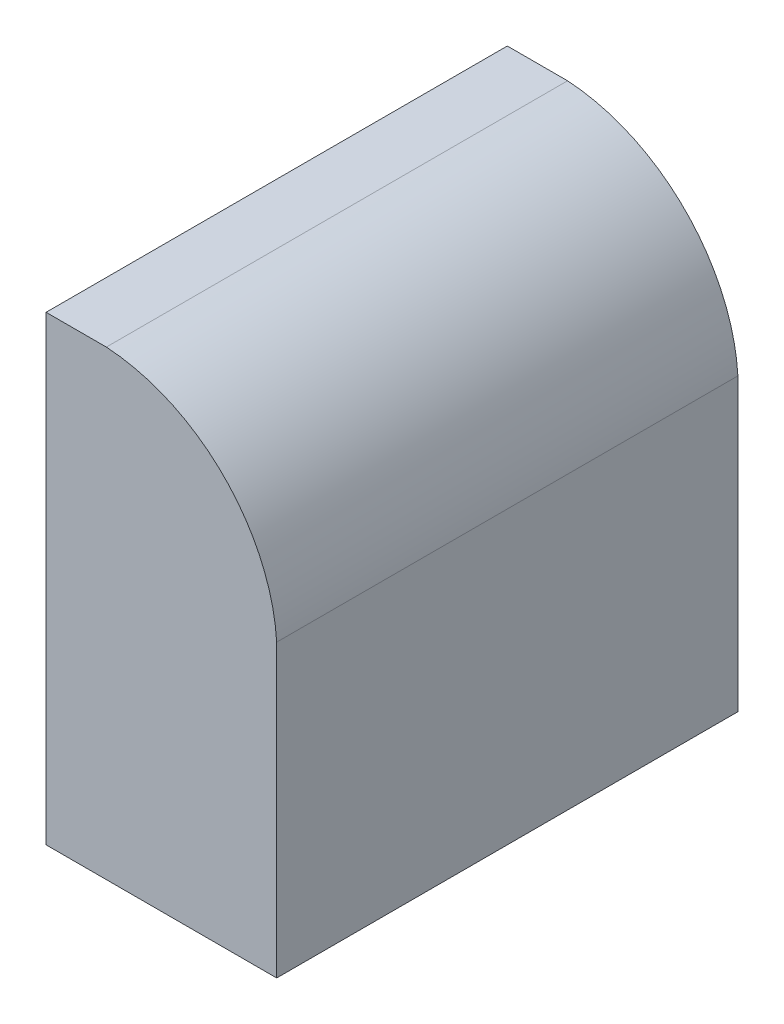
ISO-10303-21;
HEADER;
FILE_DESCRIPTION(('STEP AP214'),'2;1');
FILE_NAME('part.step','',(''),(''),'','','');
FILE_SCHEMA(('AUTOMOTIVE_DESIGN { 1 0 10303 214 1 1 1 1 }'));
ENDSEC;
DATA;
#1=APPLICATION_CONTEXT('core data for automotive mechanical design processes');
#2=APPLICATION_PROTOCOL_DEFINITION('international standard','automotive_design',2000,#1);
#3=PRODUCT_CONTEXT('',#1,'mechanical');
#4=PRODUCT('Part','Part','',(#3));
#5=PRODUCT_RELATED_PRODUCT_CATEGORY('part','',(#4));
#6=PRODUCT_DEFINITION_FORMATION('','',#4);
#7=PRODUCT_DEFINITION_CONTEXT('part definition',#1,'design');
#8=PRODUCT_DEFINITION('design','',#6,#7);
#9=PRODUCT_DEFINITION_SHAPE('','',#8);
#10=(LENGTH_UNIT() NAMED_UNIT(*) SI_UNIT(.MILLI.,.METRE.));
#11=(NAMED_UNIT(*) PLANE_ANGLE_UNIT() SI_UNIT($,.RADIAN.));
#12=(NAMED_UNIT(*) SI_UNIT($,.STERADIAN.) SOLID_ANGLE_UNIT());
#13=UNCERTAINTY_MEASURE_WITH_UNIT(LENGTH_MEASURE(1.E-05),#10,'distance_accuracy_value','');
#14=(GEOMETRIC_REPRESENTATION_CONTEXT(3) GLOBAL_UNCERTAINTY_ASSIGNED_CONTEXT((#13)) GLOBAL_UNIT_ASSIGNED_CONTEXT((#10,
#11,#12)) REPRESENTATION_CONTEXT('',''));
#15=CARTESIAN_POINT('',(0.,0.,0.));
#16=DIRECTION('',(0.,0.,1.));
#17=DIRECTION('',(1.,0.,0.));
#18=AXIS2_PLACEMENT_3D('',#15,#16,#17);
#19=CARTESIAN_POINT('',(0.,0.,25.4));
#20=DIRECTION('',(1.,0.,0.));
#21=DIRECTION('',(0.,0.,-1.));
#22=AXIS2_PLACEMENT_3D('',#19,#20,#21);
#23=PLANE('',#22);
#24=CARTESIAN_POINT('',(0.,19.1185714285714,19.05));
#25=DIRECTION('',(-1.,0.,0.));
#26=DIRECTION('',(0.,0.,1.));
#27=AXIS2_PLACEMENT_3D('',#24,#25,#26);
#28=CIRCLE('',#27,3.175);
#29=CARTESIAN_POINT('',(0.,19.1185714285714,22.225));
#30=VERTEX_POINT('',#29);
#31=EDGE_CURVE('E144',#30,#30,#28,.T.);
#32=ORIENTED_EDGE('',*,*,#31,.F.);
#33=EDGE_LOOP('',(#32));
#34=FACE_BOUND('',#33,.T.);
#35=CARTESIAN_POINT('',(0.,18.8620900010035,6.60928131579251));
#36=DIRECTION('',(-1.,0.,0.));
#37=DIRECTION('',(0.,0.,1.));
#38=AXIS2_PLACEMENT_3D('',#35,#36,#37);
#39=CIRCLE('',#38,3.175);
#40=CARTESIAN_POINT('',(0.,18.8620900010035,9.78428131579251));
#41=VERTEX_POINT('',#40);
#42=EDGE_CURVE('E147',#41,#41,#39,.T.);
#43=ORIENTED_EDGE('',*,*,#42,.F.);
#44=EDGE_LOOP('',(#43));
#45=FACE_BOUND('',#44,.T.);
#46=DIRECTION('',(0.,-1.,0.));
#47=VECTOR('',#46,1.);
#48=CARTESIAN_POINT('',(0.,0.,0.));
#49=LINE('',#48,#47);
#50=CARTESIAN_POINT('',(0.,25.4,0.));
#51=VERTEX_POINT('',#50);
#52=CARTESIAN_POINT('',(0.,0.,0.));
#53=VERTEX_POINT('',#52);
#54=EDGE_CURVE('E107',#51,#53,#49,.T.);
#55=ORIENTED_EDGE('',*,*,#54,.T.);
#56=DIRECTION('',(0.,0.,-1.));
#57=VECTOR('',#56,1.);
#58=CARTESIAN_POINT('',(0.,0.,25.4));
#59=LINE('',#58,#57);
#60=CARTESIAN_POINT('',(0.,0.,25.4));
#61=VERTEX_POINT('',#60);
#62=EDGE_CURVE('E11',#61,#53,#59,.T.);
#63=ORIENTED_EDGE('',*,*,#62,.F.);
#64=DIRECTION('',(0.,-1.,0.));
#65=VECTOR('',#64,1.);
#66=CARTESIAN_POINT('',(0.,0.,25.4));
#67=LINE('',#66,#65);
#68=CARTESIAN_POINT('',(0.,25.4,25.4));
#69=VERTEX_POINT('',#68);
#70=EDGE_CURVE('E116',#69,#61,#67,.T.);
#71=ORIENTED_EDGE('',*,*,#70,.F.);
#72=DIRECTION('',(0.,0.,-1.));
#73=VECTOR('',#72,1.);
#74=CARTESIAN_POINT('',(0.,25.4,25.4));
#75=LINE('',#74,#73);
#76=EDGE_CURVE('E103',#69,#51,#75,.T.);
#77=ORIENTED_EDGE('',*,*,#76,.T.);
#78=EDGE_LOOP('',(#55,#63,#71,#77));
#79=FACE_BOUND('',#78,.T.);
#80=ADVANCED_FACE('F33',(#34,#45,#79),#23,.F.);
#81=CARTESIAN_POINT('',(0.,0.,25.4));
#82=DIRECTION('',(0.,1.,0.));
#83=DIRECTION('',(0.,0.,1.));
#84=AXIS2_PLACEMENT_3D('',#81,#82,#83);
#85=PLANE('',#84);
#86=CARTESIAN_POINT('',(6.35,0.,6.35));
#87=DIRECTION('',(0.,-1.,0.));
#88=DIRECTION('',(0.,0.,-1.));
#89=AXIS2_PLACEMENT_3D('',#86,#87,#88);
#90=CIRCLE('',#89,1.8288);
#91=CARTESIAN_POINT('',(6.35,0.,4.5212));
#92=VERTEX_POINT('',#91);
#93=EDGE_CURVE('E153',#92,#92,#90,.T.);
#94=ORIENTED_EDGE('',*,*,#93,.F.);
#95=EDGE_LOOP('',(#94));
#96=FACE_BOUND('',#95,.T.);
#97=CARTESIAN_POINT('',(6.35,0.,19.05));
#98=DIRECTION('',(0.,-1.,0.));
#99=DIRECTION('',(0.,0.,-1.));
#100=AXIS2_PLACEMENT_3D('',#97,#98,#99);
#101=CIRCLE('',#100,1.8288);
#102=CARTESIAN_POINT('',(6.35,0.,17.2212));
#103=VERTEX_POINT('',#102);
#104=EDGE_CURVE('E162',#103,#103,#101,.T.);
#105=ORIENTED_EDGE('',*,*,#104,.F.);
#106=EDGE_LOOP('',(#105));
#107=FACE_BOUND('',#106,.T.);
#108=DIRECTION('',(1.,0.,0.));
#109=VECTOR('',#108,1.);
#110=CARTESIAN_POINT('',(0.,0.,0.));
#111=LINE('',#110,#109);
#112=CARTESIAN_POINT('',(12.7,0.,0.));
#113=VERTEX_POINT('',#112);
#114=EDGE_CURVE('E110',#53,#113,#111,.T.);
#115=ORIENTED_EDGE('',*,*,#114,.T.);
#116=DIRECTION('',(0.,0.,-1.));
#117=VECTOR('',#116,1.);
#118=CARTESIAN_POINT('',(12.7,0.,25.4));
#119=LINE('',#118,#117);
#120=CARTESIAN_POINT('',(12.7,0.,25.4));
#121=VERTEX_POINT('',#120);
#122=EDGE_CURVE('E41',#121,#113,#119,.T.);
#123=ORIENTED_EDGE('',*,*,#122,.F.);
#124=DIRECTION('',(1.,0.,0.));
#125=VECTOR('',#124,1.);
#126=CARTESIAN_POINT('',(0.,0.,25.4));
#127=LINE('',#126,#125);
#128=EDGE_CURVE('E83',#61,#121,#127,.T.);
#129=ORIENTED_EDGE('',*,*,#128,.F.);
#130=ORIENTED_EDGE('',*,*,#62,.T.);
#131=EDGE_LOOP('',(#115,#123,#129,#130));
#132=FACE_BOUND('',#131,.T.);
#133=ADVANCED_FACE('F135',(#96,#107,#132),#85,.F.);
#134=CARTESIAN_POINT('',(12.7,0.,25.4));
#135=DIRECTION('',(-1.,0.,0.));
#136=DIRECTION('',(0.,0.,1.));
#137=AXIS2_PLACEMENT_3D('',#134,#135,#136);
#138=PLANE('',#137);
#139=DIRECTION('',(0.,1.,0.));
#140=VECTOR('',#139,1.);
#141=CARTESIAN_POINT('',(12.7,0.,0.));
#142=LINE('',#141,#140);
#143=CARTESIAN_POINT('',(12.7,16.0185152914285,0.));
#144=VERTEX_POINT('',#143);
#145=EDGE_CURVE('E98',#113,#144,#142,.T.);
#146=ORIENTED_EDGE('',*,*,#145,.T.);
#147=DIRECTION('',(0.,0.,-1.));
#148=VECTOR('',#147,1.);
#149=CARTESIAN_POINT('',(12.7,16.0185152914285,25.4));
#150=LINE('',#149,#148);
#151=CARTESIAN_POINT('',(12.7,16.0185152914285,25.4));
#152=VERTEX_POINT('',#151);
#153=EDGE_CURVE('E95',#152,#144,#150,.T.);
#154=ORIENTED_EDGE('',*,*,#153,.F.);
#155=DIRECTION('',(0.,1.,0.));
#156=VECTOR('',#155,1.);
#157=CARTESIAN_POINT('',(12.7,0.,25.4));
#158=LINE('',#157,#156);
#159=EDGE_CURVE('E87',#121,#152,#158,.T.);
#160=ORIENTED_EDGE('',*,*,#159,.F.);
#161=ORIENTED_EDGE('',*,*,#122,.T.);
#162=EDGE_LOOP('',(#146,#154,#160,#161));
#163=FACE_BOUND('',#162,.T.);
#164=ADVANCED_FACE('F96',(#163),#138,.F.);
#165=CARTESIAN_POINT('',(2.69005830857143,15.3900583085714,25.4));
#166=DIRECTION('',(0.,0.,-1.));
#167=DIRECTION('',(-1.,0.,0.));
#168=AXIS2_PLACEMENT_3D('',#165,#166,#167);
#169=CYLINDRICAL_SURFACE('',#168,10.0296505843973);
#170=CARTESIAN_POINT('',(2.69005830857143,15.3900583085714,0.));
#171=DIRECTION('',(0.,0.,1.));
#172=DIRECTION('',(-1.,0.,0.));
#173=AXIS2_PLACEMENT_3D('',#170,#171,#172);
#174=CIRCLE('',#173,10.0296505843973);
#175=CARTESIAN_POINT('',(3.31851529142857,25.4,0.));
#176=VERTEX_POINT('',#175);
#177=EDGE_CURVE('E69',#144,#176,#174,.T.);
#178=ORIENTED_EDGE('',*,*,#177,.T.);
#179=DIRECTION('',(0.,0.,-1.));
#180=VECTOR('',#179,1.);
#181=CARTESIAN_POINT('',(3.31851529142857,25.4,25.4));
#182=LINE('',#181,#180);
#183=CARTESIAN_POINT('',(3.31851529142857,25.4,25.4));
#184=VERTEX_POINT('',#183);
#185=EDGE_CURVE('E99',#184,#176,#182,.T.);
#186=ORIENTED_EDGE('',*,*,#185,.F.);
#187=CARTESIAN_POINT('',(2.69005830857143,15.3900583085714,25.4));
#188=DIRECTION('',(0.,0.,1.));
#189=DIRECTION('',(-1.,0.,0.));
#190=AXIS2_PLACEMENT_3D('',#187,#188,#189);
#191=CIRCLE('',#190,10.0296505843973);
#192=EDGE_CURVE('E91',#152,#184,#191,.T.);
#193=ORIENTED_EDGE('',*,*,#192,.F.);
#194=ORIENTED_EDGE('',*,*,#153,.T.);
#195=EDGE_LOOP('',(#178,#186,#193,#194));
#196=FACE_BOUND('',#195,.T.);
#197=ADVANCED_FACE('F101',(#196),#169,.T.);
#198=CARTESIAN_POINT('',(3.31851529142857,25.4,25.4));
#199=DIRECTION('',(0.,-1.,0.));
#200=DIRECTION('',(0.,0.,-1.));
#201=AXIS2_PLACEMENT_3D('',#198,#199,#200);
#202=PLANE('',#201);
#203=DIRECTION('',(-1.,0.,0.));
#204=VECTOR('',#203,1.);
#205=CARTESIAN_POINT('',(3.31851529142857,25.4,0.));
#206=LINE('',#205,#204);
#207=EDGE_CURVE('E75',#176,#51,#206,.T.);
#208=ORIENTED_EDGE('',*,*,#207,.T.);
#209=ORIENTED_EDGE('',*,*,#76,.F.);
#210=DIRECTION('',(-1.,0.,0.));
#211=VECTOR('',#210,1.);
#212=CARTESIAN_POINT('',(3.31851529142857,25.4,25.4));
#213=LINE('',#212,#211);
#214=EDGE_CURVE('E49',#184,#69,#213,.T.);
#215=ORIENTED_EDGE('',*,*,#214,.F.);
#216=ORIENTED_EDGE('',*,*,#185,.T.);
#217=EDGE_LOOP('',(#208,#209,#215,#216));
#218=FACE_BOUND('',#217,.T.);
#219=ADVANCED_FACE('F124',(#218),#202,.F.);
#220=CARTESIAN_POINT('',(2.69005830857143,15.3900583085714,25.4));
#221=DIRECTION('',(0.,0.,-1.));
#222=DIRECTION('',(-1.,0.,0.));
#223=AXIS2_PLACEMENT_3D('',#220,#221,#222);
#224=PLANE('',#223);
#225=ORIENTED_EDGE('',*,*,#70,.T.);
#226=ORIENTED_EDGE('',*,*,#128,.T.);
#227=ORIENTED_EDGE('',*,*,#159,.T.);
#228=ORIENTED_EDGE('',*,*,#192,.T.);
#229=ORIENTED_EDGE('',*,*,#214,.T.);
#230=EDGE_LOOP('',(#225,#226,#227,#228,#229));
#231=FACE_BOUND('',#230,.T.);
#232=ADVANCED_FACE('F89',(#231),#224,.F.);
#233=CARTESIAN_POINT('',(2.69005830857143,15.3900583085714,0.));
#234=DIRECTION('',(0.,0.,-1.));
#235=DIRECTION('',(-1.,0.,0.));
#236=AXIS2_PLACEMENT_3D('',#233,#234,#235);
#237=PLANE('',#236);
#238=ORIENTED_EDGE('',*,*,#54,.F.);
#239=ORIENTED_EDGE('',*,*,#207,.F.);
#240=ORIENTED_EDGE('',*,*,#177,.F.);
#241=ORIENTED_EDGE('',*,*,#145,.F.);
#242=ORIENTED_EDGE('',*,*,#114,.F.);
#243=EDGE_LOOP('',(#238,#239,#240,#241,#242));
#244=FACE_BOUND('',#243,.T.);
#245=ADVANCED_FACE('F120',(#244),#237,.T.);
#246=CARTESIAN_POINT('',(6.35,12.7,19.05));
#247=DIRECTION('',(0.,-1.,0.));
#248=DIRECTION('',(0.,0.,-1.));
#249=AXIS2_PLACEMENT_3D('',#246,#247,#248);
#250=CYLINDRICAL_SURFACE('',#249,1.8288);
#251=CARTESIAN_POINT('',(6.35,12.7,19.05));
#252=DIRECTION('',(0.,-1.,0.));
#253=DIRECTION('',(0.,0.,-1.));
#254=AXIS2_PLACEMENT_3D('',#251,#252,#253);
#255=CIRCLE('',#254,1.8288);
#256=CARTESIAN_POINT('',(6.35,12.7,17.2212));
#257=VERTEX_POINT('',#256);
#258=EDGE_CURVE('E111',#257,#257,#255,.T.);
#259=ORIENTED_EDGE('',*,*,#258,.F.);
#260=EDGE_LOOP('',(#259));
#261=FACE_BOUND('',#260,.T.);
#262=ORIENTED_EDGE('',*,*,#104,.T.);
#263=EDGE_LOOP('',(#262));
#264=FACE_BOUND('',#263,.T.);
#265=ADVANCED_FACE('F171',(#261,#264),#250,.F.);
#266=CARTESIAN_POINT('',(6.35,12.7,19.05));
#267=DIRECTION('',(0.,-1.,0.));
#268=DIRECTION('',(0.,0.,-1.));
#269=AXIS2_PLACEMENT_3D('',#266,#267,#268);
#270=PLANE('',#269);
#271=ORIENTED_EDGE('',*,*,#258,.T.);
#272=EDGE_LOOP('',(#271));
#273=FACE_BOUND('',#272,.T.);
#274=ADVANCED_FACE('F174',(#273),#270,.T.);
#275=CARTESIAN_POINT('',(6.35,12.7,6.35));
#276=DIRECTION('',(0.,-1.,0.));
#277=DIRECTION('',(0.,0.,-1.));
#278=AXIS2_PLACEMENT_3D('',#275,#276,#277);
#279=CYLINDRICAL_SURFACE('',#278,1.8288);
#280=CARTESIAN_POINT('',(6.35,12.7,6.35));
#281=DIRECTION('',(0.,-1.,0.));
#282=DIRECTION('',(0.,0.,-1.));
#283=AXIS2_PLACEMENT_3D('',#280,#281,#282);
#284=CIRCLE('',#283,1.8288);
#285=CARTESIAN_POINT('',(6.35,12.7,4.5212));
#286=VERTEX_POINT('',#285);
#287=EDGE_CURVE('E159',#286,#286,#284,.T.);
#288=ORIENTED_EDGE('',*,*,#287,.F.);
#289=EDGE_LOOP('',(#288));
#290=FACE_BOUND('',#289,.T.);
#291=ORIENTED_EDGE('',*,*,#93,.T.);
#292=EDGE_LOOP('',(#291));
#293=FACE_BOUND('',#292,.T.);
#294=ADVANCED_FACE('F181',(#290,#293),#279,.F.);
#295=CARTESIAN_POINT('',(6.35,12.7,6.35));
#296=DIRECTION('',(0.,-1.,0.));
#297=DIRECTION('',(0.,0.,-1.));
#298=AXIS2_PLACEMENT_3D('',#295,#296,#297);
#299=PLANE('',#298);
#300=ORIENTED_EDGE('',*,*,#287,.T.);
#301=EDGE_LOOP('',(#300));
#302=FACE_BOUND('',#301,.T.);
#303=ADVANCED_FACE('F188',(#302),#299,.T.);
#304=CARTESIAN_POINT('',(3.,18.8620900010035,6.60928131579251));
#305=DIRECTION('',(-1.,0.,0.));
#306=DIRECTION('',(0.,0.,1.));
#307=AXIS2_PLACEMENT_3D('',#304,#305,#306);
#308=CYLINDRICAL_SURFACE('',#307,3.175);
#309=CARTESIAN_POINT('',(3.,18.8620900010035,6.60928131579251));
#310=DIRECTION('',(-1.,0.,0.));
#311=DIRECTION('',(0.,0.,1.));
#312=AXIS2_PLACEMENT_3D('',#309,#310,#311);
#313=CIRCLE('',#312,3.175);
#314=CARTESIAN_POINT('',(3.,18.8620900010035,9.78428131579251));
#315=VERTEX_POINT('',#314);
#316=EDGE_CURVE('E149',#315,#315,#313,.T.);
#317=ORIENTED_EDGE('',*,*,#316,.F.);
#318=EDGE_LOOP('',(#317));
#319=FACE_BOUND('',#318,.T.);
#320=ORIENTED_EDGE('',*,*,#42,.T.);
#321=EDGE_LOOP('',(#320));
#322=FACE_BOUND('',#321,.T.);
#323=ADVANCED_FACE('F192',(#319,#322),#308,.F.);
#324=CARTESIAN_POINT('',(3.,18.8620900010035,6.60928131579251));
#325=DIRECTION('',(-1.,0.,0.));
#326=DIRECTION('',(0.,0.,1.));
#327=AXIS2_PLACEMENT_3D('',#324,#325,#326);
#328=PLANE('',#327);
#329=ORIENTED_EDGE('',*,*,#316,.T.);
#330=EDGE_LOOP('',(#329));
#331=FACE_BOUND('',#330,.T.);
#332=ADVANCED_FACE('F196',(#331),#328,.T.);
#333=CARTESIAN_POINT('',(3.,19.1185714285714,19.05));
#334=DIRECTION('',(-1.,0.,0.));
#335=DIRECTION('',(0.,0.,1.));
#336=AXIS2_PLACEMENT_3D('',#333,#334,#335);
#337=CYLINDRICAL_SURFACE('',#336,3.175);
#338=CARTESIAN_POINT('',(3.,19.1185714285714,19.05));
#339=DIRECTION('',(-1.,0.,0.));
#340=DIRECTION('',(0.,0.,1.));
#341=AXIS2_PLACEMENT_3D('',#338,#339,#340);
#342=CIRCLE('',#341,3.175);
#343=CARTESIAN_POINT('',(3.,19.1185714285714,22.225));
#344=VERTEX_POINT('',#343);
#345=EDGE_CURVE('E150',#344,#344,#342,.T.);
#346=ORIENTED_EDGE('',*,*,#345,.F.);
#347=EDGE_LOOP('',(#346));
#348=FACE_BOUND('',#347,.T.);
#349=ORIENTED_EDGE('',*,*,#31,.T.);
#350=EDGE_LOOP('',(#349));
#351=FACE_BOUND('',#350,.T.);
#352=ADVANCED_FACE('F200',(#348,#351),#337,.F.);
#353=CARTESIAN_POINT('',(3.,19.1185714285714,19.05));
#354=DIRECTION('',(-1.,0.,0.));
#355=DIRECTION('',(0.,0.,1.));
#356=AXIS2_PLACEMENT_3D('',#353,#354,#355);
#357=PLANE('',#356);
#358=ORIENTED_EDGE('',*,*,#345,.T.);
#359=EDGE_LOOP('',(#358));
#360=FACE_BOUND('',#359,.T.);
#361=ADVANCED_FACE('F204',(#360),#357,.T.);
#362=CLOSED_SHELL('',(#80,#133,#164,#197,#219,#232,#245,#265,#274,#294,#303,#323,#332,#352,#361));
#363=MANIFOLD_SOLID_BREP('B2',#362);
#364=ADVANCED_BREP_SHAPE_REPRESENTATION('',(#18,#363),#14);
#365=SHAPE_DEFINITION_REPRESENTATION(#9,#364);
ENDSEC;
END-ISO-10303-21;
